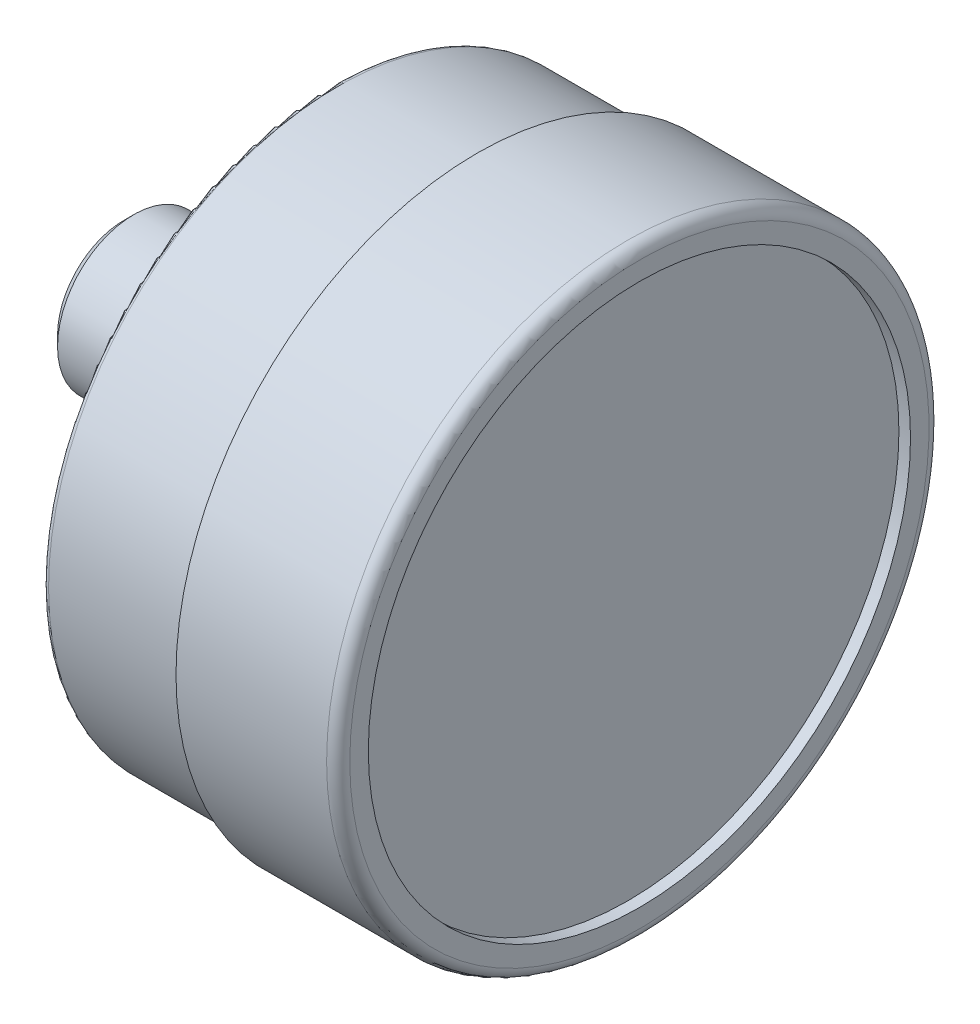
ISO-10303-21;
HEADER;
FILE_DESCRIPTION(('STEP AP214'),'2;1');
FILE_NAME('part.step','',(''),(''),'','','');
FILE_SCHEMA(('AUTOMOTIVE_DESIGN { 1 0 10303 214 1 1 1 1 }'));
ENDSEC;
DATA;
#1=APPLICATION_CONTEXT('core data for automotive mechanical design processes');
#2=APPLICATION_PROTOCOL_DEFINITION('international standard','automotive_design',2000,#1);
#3=PRODUCT_CONTEXT('',#1,'mechanical');
#4=PRODUCT('Part','Part','',(#3));
#5=PRODUCT_RELATED_PRODUCT_CATEGORY('part','',(#4));
#6=PRODUCT_DEFINITION_FORMATION('','',#4);
#7=PRODUCT_DEFINITION_CONTEXT('part definition',#1,'design');
#8=PRODUCT_DEFINITION('design','',#6,#7);
#9=PRODUCT_DEFINITION_SHAPE('','',#8);
#10=(LENGTH_UNIT() NAMED_UNIT(*) SI_UNIT(.MILLI.,.METRE.));
#11=(NAMED_UNIT(*) PLANE_ANGLE_UNIT() SI_UNIT($,.RADIAN.));
#12=(NAMED_UNIT(*) SI_UNIT($,.STERADIAN.) SOLID_ANGLE_UNIT());
#13=UNCERTAINTY_MEASURE_WITH_UNIT(LENGTH_MEASURE(1.E-05),#10,'distance_accuracy_value','');
#14=(GEOMETRIC_REPRESENTATION_CONTEXT(3) GLOBAL_UNCERTAINTY_ASSIGNED_CONTEXT((#13)) GLOBAL_UNIT_ASSIGNED_CONTEXT((#10,
#11,#12)) REPRESENTATION_CONTEXT('',''));
#15=CARTESIAN_POINT('',(0.,0.,0.));
#16=DIRECTION('',(0.,0.,1.));
#17=DIRECTION('',(1.,0.,0.));
#18=AXIS2_PLACEMENT_3D('',#15,#16,#17);
#19=CARTESIAN_POINT('',(0.,6.5785,0.));
#20=DIRECTION('',(1.,0.,0.));
#21=DIRECTION('',(0.,0.,-1.));
#22=AXIS2_PLACEMENT_3D('',#19,#20,#21);
#23=PLANE('',#22);
#24=CARTESIAN_POINT('',(0.,0.,0.));
#25=DIRECTION('',(-1.,0.,0.));
#26=DIRECTION('',(0.,0.,1.));
#27=AXIS2_PLACEMENT_3D('',#24,#25,#26);
#28=CIRCLE('',#27,24.5);
#29=CARTESIAN_POINT('',(0.,0.,24.5));
#30=VERTEX_POINT('',#29);
#31=EDGE_CURVE('E177',#30,#30,#28,.T.);
#32=ORIENTED_EDGE('',*,*,#31,.T.);
#33=EDGE_LOOP('',(#32));
#34=FACE_BOUND('',#33,.T.);
#35=DIRECTION('',(0.,-1.,0.));
#36=VECTOR('',#35,1.);
#37=CARTESIAN_POINT('',(0.,6.5785,6.5785));
#38=LINE('',#37,#36);
#39=CARTESIAN_POINT('',(0.,6.5785,6.5785));
#40=VERTEX_POINT('',#39);
#41=CARTESIAN_POINT('',(0.,-6.5785,6.5785));
#42=VERTEX_POINT('',#41);
#43=EDGE_CURVE('E110',#40,#42,#38,.T.);
#44=ORIENTED_EDGE('',*,*,#43,.T.);
#45=DIRECTION('',(0.,0.,-1.));
#46=VECTOR('',#45,1.);
#47=CARTESIAN_POINT('',(0.,-6.5785,6.5785));
#48=LINE('',#47,#46);
#49=CARTESIAN_POINT('',(0.,-6.5785,-6.5785));
#50=VERTEX_POINT('',#49);
#51=EDGE_CURVE('E95',#42,#50,#48,.T.);
#52=ORIENTED_EDGE('',*,*,#51,.T.);
#53=DIRECTION('',(0.,1.,0.));
#54=VECTOR('',#53,1.);
#55=CARTESIAN_POINT('',(0.,-6.5785,-6.5785));
#56=LINE('',#55,#54);
#57=CARTESIAN_POINT('',(0.,6.5785,-6.5785));
#58=VERTEX_POINT('',#57);
#59=EDGE_CURVE('E107',#50,#58,#56,.T.);
#60=ORIENTED_EDGE('',*,*,#59,.T.);
#61=DIRECTION('',(0.,0.,1.));
#62=VECTOR('',#61,1.);
#63=CARTESIAN_POINT('',(0.,6.5785,-6.5785));
#64=LINE('',#63,#62);
#65=EDGE_CURVE('E114',#58,#40,#64,.T.);
#66=ORIENTED_EDGE('',*,*,#65,.T.);
#67=EDGE_LOOP('',(#44,#52,#60,#66));
#68=FACE_BOUND('',#67,.T.);
#69=ADVANCED_FACE('F39',(#34,#68),#23,.F.);
#70=CARTESIAN_POINT('',(0.500000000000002,0.,0.));
#71=DIRECTION('',(-1.,0.,0.));
#72=DIRECTION('',(0.,0.,1.));
#73=AXIS2_PLACEMENT_3D('',#70,#71,#72);
#74=TOROIDAL_SURFACE('',#73,24.5,0.500000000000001);
#75=ORIENTED_EDGE('',*,*,#31,.F.);
#76=EDGE_LOOP('',(#75));
#77=FACE_BOUND('',#76,.T.);
#78=CARTESIAN_POINT('',(0.499999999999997,0.,0.));
#79=DIRECTION('',(-1.,0.,0.));
#80=DIRECTION('',(0.,0.,1.));
#81=AXIS2_PLACEMENT_3D('',#78,#79,#80);
#82=CIRCLE('',#81,25.);
#83=CARTESIAN_POINT('',(0.499999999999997,0.,25.));
#84=VERTEX_POINT('',#83);
#85=EDGE_CURVE('E174',#84,#84,#82,.T.);
#86=ORIENTED_EDGE('',*,*,#85,.T.);
#87=EDGE_LOOP('',(#86));
#88=FACE_BOUND('',#87,.T.);
#89=ADVANCED_FACE('F214',(#77,#88),#74,.T.);
#90=CARTESIAN_POINT('',(25.5,0.,0.));
#91=DIRECTION('',(-1.,0.,0.));
#92=DIRECTION('',(0.,0.,1.));
#93=AXIS2_PLACEMENT_3D('',#90,#91,#92);
#94=CYLINDRICAL_SURFACE('',#93,25.);
#95=ORIENTED_EDGE('',*,*,#85,.F.);
#96=EDGE_LOOP('',(#95));
#97=FACE_BOUND('',#96,.T.);
#98=CARTESIAN_POINT('',(12.5,0.,0.));
#99=DIRECTION('',(-1.,0.,0.));
#100=DIRECTION('',(0.,0.,1.));
#101=AXIS2_PLACEMENT_3D('',#98,#99,#100);
#102=CIRCLE('',#101,25.);
#103=CARTESIAN_POINT('',(12.5,0.,25.));
#104=VERTEX_POINT('',#103);
#105=EDGE_CURVE('E171',#104,#104,#102,.T.);
#106=ORIENTED_EDGE('',*,*,#105,.T.);
#107=EDGE_LOOP('',(#106));
#108=FACE_BOUND('',#107,.T.);
#109=ADVANCED_FACE('F220',(#97,#108),#94,.T.);
#110=CARTESIAN_POINT('',(12.5,25.,0.));
#111=DIRECTION('',(1.,0.,0.));
#112=DIRECTION('',(0.,0.,-1.));
#113=AXIS2_PLACEMENT_3D('',#110,#111,#112);
#114=PLANE('',#113);
#115=ORIENTED_EDGE('',*,*,#105,.F.);
#116=EDGE_LOOP('',(#115));
#117=FACE_BOUND('',#116,.T.);
#118=CARTESIAN_POINT('',(12.5,0.,0.));
#119=DIRECTION('',(-1.,0.,0.));
#120=DIRECTION('',(0.,0.,1.));
#121=AXIS2_PLACEMENT_3D('',#118,#119,#120);
#122=CIRCLE('',#121,26.);
#123=CARTESIAN_POINT('',(12.5,0.,26.));
#124=VERTEX_POINT('',#123);
#125=EDGE_CURVE('E168',#124,#124,#122,.T.);
#126=ORIENTED_EDGE('',*,*,#125,.T.);
#127=EDGE_LOOP('',(#126));
#128=FACE_BOUND('',#127,.T.);
#129=ADVANCED_FACE('F298',(#117,#128),#114,.F.);
#130=CARTESIAN_POINT('',(25.5,0.,0.));
#131=DIRECTION('',(-1.,0.,0.));
#132=DIRECTION('',(0.,0.,1.));
#133=AXIS2_PLACEMENT_3D('',#130,#131,#132);
#134=CYLINDRICAL_SURFACE('',#133,26.);
#135=ORIENTED_EDGE('',*,*,#125,.F.);
#136=EDGE_LOOP('',(#135));
#137=FACE_BOUND('',#136,.T.);
#138=CARTESIAN_POINT('',(25.5,0.,0.));
#139=DIRECTION('',(-1.,0.,0.));
#140=DIRECTION('',(0.,0.,1.));
#141=AXIS2_PLACEMENT_3D('',#138,#139,#140);
#142=CIRCLE('',#141,26.);
#143=CARTESIAN_POINT('',(25.5,0.,26.));
#144=VERTEX_POINT('',#143);
#145=EDGE_CURVE('E165',#144,#144,#142,.T.);
#146=ORIENTED_EDGE('',*,*,#145,.T.);
#147=EDGE_LOOP('',(#146));
#148=FACE_BOUND('',#147,.T.);
#149=ADVANCED_FACE('F290',(#137,#148),#134,.T.);
#150=CARTESIAN_POINT('',(25.5,0.,0.));
#151=DIRECTION('',(-1.,0.,0.));
#152=DIRECTION('',(0.,0.,1.));
#153=AXIS2_PLACEMENT_3D('',#150,#151,#152);
#154=TOROIDAL_SURFACE('',#153,25.,1.00000000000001);
#155=ORIENTED_EDGE('',*,*,#145,.F.);
#156=EDGE_LOOP('',(#155));
#157=FACE_BOUND('',#156,.T.);
#158=CARTESIAN_POINT('',(26.5,0.,0.));
#159=DIRECTION('',(-1.,0.,0.));
#160=DIRECTION('',(0.,0.,1.));
#161=AXIS2_PLACEMENT_3D('',#158,#159,#160);
#162=CIRCLE('',#161,25.);
#163=CARTESIAN_POINT('',(26.5,0.,25.));
#164=VERTEX_POINT('',#163);
#165=EDGE_CURVE('E162',#164,#164,#162,.T.);
#166=ORIENTED_EDGE('',*,*,#165,.T.);
#167=EDGE_LOOP('',(#166));
#168=FACE_BOUND('',#167,.T.);
#169=ADVANCED_FACE('F281',(#157,#168),#154,.T.);
#170=CARTESIAN_POINT('',(26.5,25.,0.));
#171=DIRECTION('',(-1.,0.,0.));
#172=DIRECTION('',(0.,0.,1.));
#173=AXIS2_PLACEMENT_3D('',#170,#171,#172);
#174=PLANE('',#173);
#175=ORIENTED_EDGE('',*,*,#165,.F.);
#176=EDGE_LOOP('',(#175));
#177=FACE_BOUND('',#176,.T.);
#178=CARTESIAN_POINT('',(26.5,0.,0.));
#179=DIRECTION('',(-1.,0.,0.));
#180=DIRECTION('',(0.,0.,1.));
#181=AXIS2_PLACEMENT_3D('',#178,#179,#180);
#182=CIRCLE('',#181,23.4);
#183=CARTESIAN_POINT('',(26.5,0.,23.4));
#184=VERTEX_POINT('',#183);
#185=EDGE_CURVE('E159',#184,#184,#182,.T.);
#186=ORIENTED_EDGE('',*,*,#185,.T.);
#187=EDGE_LOOP('',(#186));
#188=FACE_BOUND('',#187,.T.);
#189=ADVANCED_FACE('F271',(#177,#188),#174,.F.);
#190=CARTESIAN_POINT('',(25.5,0.,0.));
#191=DIRECTION('',(-1.,0.,0.));
#192=DIRECTION('',(0.,0.,1.));
#193=AXIS2_PLACEMENT_3D('',#190,#191,#192);
#194=CYLINDRICAL_SURFACE('',#193,23.4);
#195=ORIENTED_EDGE('',*,*,#185,.F.);
#196=EDGE_LOOP('',(#195));
#197=FACE_BOUND('',#196,.T.);
#198=CARTESIAN_POINT('',(25.5,0.,0.));
#199=DIRECTION('',(-1.,0.,0.));
#200=DIRECTION('',(0.,0.,1.));
#201=AXIS2_PLACEMENT_3D('',#198,#199,#200);
#202=CIRCLE('',#201,23.4);
#203=CARTESIAN_POINT('',(25.5,0.,23.4));
#204=VERTEX_POINT('',#203);
#205=EDGE_CURVE('E156',#204,#204,#202,.T.);
#206=ORIENTED_EDGE('',*,*,#205,.T.);
#207=EDGE_LOOP('',(#206));
#208=FACE_BOUND('',#207,.T.);
#209=ADVANCED_FACE('F264',(#197,#208),#194,.F.);
#210=CARTESIAN_POINT('',(25.5,23.4,0.));
#211=DIRECTION('',(-1.,0.,0.));
#212=DIRECTION('',(0.,0.,1.));
#213=AXIS2_PLACEMENT_3D('',#210,#211,#212);
#214=PLANE('',#213);
#215=ORIENTED_EDGE('',*,*,#205,.F.);
#216=EDGE_LOOP('',(#215));
#217=FACE_BOUND('',#216,.T.);
#218=ADVANCED_FACE('F146',(#217),#214,.F.);
#219=CARTESIAN_POINT('',(-22.25,6.5785,6.5785));
#220=DIRECTION('',(0.,0.,1.));
#221=DIRECTION('',(1.,0.,0.));
#222=AXIS2_PLACEMENT_3D('',#219,#220,#221);
#223=PLANE('',#222);
#224=CARTESIAN_POINT('',(-9.,0.,6.5785));
#225=CARTESIAN_POINT('',(-8.99999297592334,-0.44685698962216,6.5785));
#226=CARTESIAN_POINT('',(-8.98073108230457,-0.893777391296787,6.5785));
#227=CARTESIAN_POINT('',(-8.904238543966,-1.78439195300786,6.5785));
#228=CARTESIAN_POINT('',(-8.8469996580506,-2.22808539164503,6.5785));
#229=CARTESIAN_POINT('',(-8.69588183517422,-3.10983216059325,6.5785));
#230=CARTESIAN_POINT('',(-8.6019512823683,-3.54787664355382,6.5785));
#231=CARTESIAN_POINT('',(-8.37929043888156,-4.4148961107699,6.5785));
#232=CARTESIAN_POINT('',(-8.25056081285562,-4.84387126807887,6.5785));
#233=CARTESIAN_POINT('',(-7.81605283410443,-6.11008533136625,6.5785));
#234=CARTESIAN_POINT('',(-7.46118448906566,-6.93095154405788,6.5785));
#235=CARTESIAN_POINT('',(-6.63353373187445,-8.51039385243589,6.5785));
#236=CARTESIAN_POINT('',(-6.16076803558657,-9.26897875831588,6.5785));
#237=CARTESIAN_POINT('',(-5.34049965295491,-10.3933305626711,6.5785));
#238=CARTESIAN_POINT('',(-5.02877045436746,-10.7856768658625,6.5785));
#239=CARTESIAN_POINT('',(-4.37430655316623,-11.5437634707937,6.5785));
#240=CARTESIAN_POINT('',(-4.03156961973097,-11.909501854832,6.5785));
#241=CARTESIAN_POINT('',(-3.31747288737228,-12.6120677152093,6.5785));
#242=CARTESIAN_POINT('',(-2.94610425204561,-12.9488861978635,6.5785));
#243=CARTESIAN_POINT('',(-2.17735666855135,-13.5914088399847,6.5785));
#244=CARTESIAN_POINT('',(-1.77997744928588,-13.8971126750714,6.5785));
#245=CARTESIAN_POINT('',(-0.946731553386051,-14.4861850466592,6.5785));
#246=CARTESIAN_POINT('',(-0.509985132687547,-14.7683100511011,6.5785));
#247=CARTESIAN_POINT('',(0.385530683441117,-15.2951415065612,6.5785));
#248=CARTESIAN_POINT('',(0.844300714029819,-15.5398468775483,6.5785));
#249=CARTESIAN_POINT('',(1.78065827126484,-15.9901959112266,6.5785));
#250=CARTESIAN_POINT('',(2.25824678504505,-16.1958375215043,6.5785));
#251=CARTESIAN_POINT('',(3.22888005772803,-16.5666548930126,6.5785));
#252=CARTESIAN_POINT('',(3.72192481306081,-16.7318306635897,6.5785));
#253=CARTESIAN_POINT('',(4.72536118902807,-17.0221403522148,6.5785));
#254=CARTESIAN_POINT('',(5.23588159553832,-17.1468293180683,6.5785));
#255=CARTESIAN_POINT('',(6.26559558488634,-17.3528769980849,6.5785));
#256=CARTESIAN_POINT('',(6.78478924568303,-17.4342353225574,6.5785));
#257=CARTESIAN_POINT('',(7.82817679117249,-17.5530597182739,6.5785));
#258=CARTESIAN_POINT('',(8.35237068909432,-17.5905256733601,6.5785));
#259=CARTESIAN_POINT('',(9.40205241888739,-17.6213063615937,6.5785));
#260=CARTESIAN_POINT('',(9.92754025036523,-17.6146211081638,6.5785));
#261=CARTESIAN_POINT('',(10.9776181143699,-17.5570620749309,6.5785));
#262=CARTESIAN_POINT('',(11.5022011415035,-17.5060604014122,6.5785));
#263=CARTESIAN_POINT('',(12.5452080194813,-17.3600495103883,6.5785));
#264=CARTESIAN_POINT('',(13.0636318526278,-17.2650401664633,6.5785));
#265=CARTESIAN_POINT('',(14.0906565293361,-17.0316669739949,6.5785));
#266=CARTESIAN_POINT('',(14.5992568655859,-16.8933008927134,6.5785));
#267=CARTESIAN_POINT('',(15.6029793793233,-16.5741754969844,6.5785));
#268=CARTESIAN_POINT('',(16.0981015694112,-16.3934162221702,6.5785));
#269=CARTESIAN_POINT('',(17.0711849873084,-15.9908158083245,6.5785));
#270=CARTESIAN_POINT('',(17.5491511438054,-15.7689865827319,6.5785));
#271=CARTESIAN_POINT('',(18.4846402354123,-15.2857471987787,6.5785));
#272=CARTESIAN_POINT('',(18.942163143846,-15.024336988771,6.5785));
#273=CARTESIAN_POINT('',(19.8333878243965,-14.4637862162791,6.5785));
#274=CARTESIAN_POINT('',(20.2670931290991,-14.1646512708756,6.5785));
#275=CARTESIAN_POINT('',(21.1075833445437,-13.5306879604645,6.5785));
#276=CARTESIAN_POINT('',(21.5143683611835,-13.1958597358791,6.5785));
#277=CARTESIAN_POINT('',(22.2962880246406,-12.4943516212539,6.5785));
#278=CARTESIAN_POINT('',(22.6715526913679,-12.127816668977,6.5785));
#279=CARTESIAN_POINT('',(23.3895610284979,-11.3641568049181,6.5785));
#280=CARTESIAN_POINT('',(23.7323045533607,-10.9670317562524,6.5785));
#281=CARTESIAN_POINT('',(24.3827740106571,-10.1446397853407,6.5785));
#282=CARTESIAN_POINT('',(24.6904770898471,-9.71935477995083,6.5785));
#283=CARTESIAN_POINT('',(25.2680024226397,-8.84378740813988,6.5785));
#284=CARTESIAN_POINT('',(25.5378251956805,-8.3935053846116,6.5785));
#285=CARTESIAN_POINT('',(26.0332853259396,-7.47797669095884,6.5785));
#286=CARTESIAN_POINT('',(26.2595257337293,-7.0130565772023,6.5785));
#287=CARTESIAN_POINT('',(26.6702883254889,-6.06514800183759,6.5785));
#288=CARTESIAN_POINT('',(26.8548139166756,-5.5821610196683,6.5785));
#289=CARTESIAN_POINT('',(27.1793487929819,-4.60208371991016,6.5785));
#290=CARTESIAN_POINT('',(27.3194133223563,-4.10501174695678,6.5785));
#291=CARTESIAN_POINT('',(27.552545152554,-3.09996513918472,6.5785));
#292=CARTESIAN_POINT('',(27.6456187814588,-2.59199198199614,6.5785));
#293=CARTESIAN_POINT('',(27.7775902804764,-1.60358559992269,6.5785));
#294=CARTESIAN_POINT('',(27.8196929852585,-1.12358057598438,6.5785));
#295=CARTESIAN_POINT('',(27.8593379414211,-0.161743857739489,6.5785));
#296=CARTESIAN_POINT('',(27.8568836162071,0.320087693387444,6.5785));
#297=CARTESIAN_POINT('',(27.8075061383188,1.28147446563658,6.5785));
#298=CARTESIAN_POINT('',(27.76057993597,1.76102952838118,6.5785));
#299=CARTESIAN_POINT('',(27.6237395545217,2.71395733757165,6.5785));
#300=CARTESIAN_POINT('',(27.533823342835,3.18732979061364,6.5785));
#301=CARTESIAN_POINT('',(27.3216044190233,4.08864272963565,6.5785));
#302=CARTESIAN_POINT('',(27.2022956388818,4.51729420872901,6.5785));
#303=CARTESIAN_POINT('',(26.930647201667,5.36394084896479,6.5785));
#304=CARTESIAN_POINT('',(26.7783105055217,5.78193696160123,6.5785));
#305=CARTESIAN_POINT('',(26.4422396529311,6.60523425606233,6.5785));
#306=CARTESIAN_POINT('',(26.2584962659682,7.01053166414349,6.5785));
#307=CARTESIAN_POINT('',(25.861235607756,7.80628004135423,6.5785));
#308=CARTESIAN_POINT('',(25.6477158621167,8.19672977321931,6.5785));
#309=CARTESIAN_POINT('',(25.1698007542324,8.99885630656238,6.5785));
#310=CARTESIAN_POINT('',(24.9024571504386,9.4087795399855,6.5785));
#311=CARTESIAN_POINT('',(24.3357408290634,10.2058576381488,6.5785));
#312=CARTESIAN_POINT('',(24.036366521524,10.5930113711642,6.5785));
#313=CARTESIAN_POINT('',(23.4077151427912,11.3422577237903,6.5785));
#314=CARTESIAN_POINT('',(23.078436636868,11.7043491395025,6.5785));
#315=CARTESIAN_POINT('',(22.3922227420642,12.4012926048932,6.5785));
#316=CARTESIAN_POINT('',(22.0352870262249,12.7361443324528,6.5785));
#317=CARTESIAN_POINT('',(21.2757348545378,13.3942497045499,6.5785));
#318=CARTESIAN_POINT('',(20.8716855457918,13.7158514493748,6.5785));
#319=CARTESIAN_POINT('',(20.0382611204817,14.3243863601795,6.5785));
#320=CARTESIAN_POINT('',(19.6088850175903,14.6113181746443,6.5785));
#321=CARTESIAN_POINT('',(18.7277441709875,15.1486492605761,6.5785));
#322=CARTESIAN_POINT('',(18.2759753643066,15.3990418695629,6.5785));
#323=CARTESIAN_POINT('',(17.3532628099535,15.8615649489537,6.5785));
#324=CARTESIAN_POINT('',(16.8823190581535,16.0736954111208,6.5785));
#325=CARTESIAN_POINT('',(15.9171051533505,16.4612533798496,6.5785));
#326=CARTESIAN_POINT('',(15.422587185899,16.6360639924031,6.5785));
#327=CARTESIAN_POINT('',(14.420624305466,16.943578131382,6.5785));
#328=CARTESIAN_POINT('',(13.9131792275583,17.0762811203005,6.5785));
#329=CARTESIAN_POINT('',(12.8889537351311,17.298665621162,6.5785));
#330=CARTESIAN_POINT('',(12.3721734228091,17.3883476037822,6.5785));
#331=CARTESIAN_POINT('',(11.3329151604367,17.5240757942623,6.5785));
#332=CARTESIAN_POINT('',(10.8104372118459,17.5701220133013,6.5785));
#333=CARTESIAN_POINT('',(9.76115429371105,17.6183681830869,6.5785));
#334=CARTESIAN_POINT('',(9.2343404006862,17.620374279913,6.5785));
#335=CARTESIAN_POINT('',(8.18241207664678,17.5800321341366,6.5785));
#336=CARTESIAN_POINT('',(7.65729765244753,17.5376837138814,6.5785));
#337=CARTESIAN_POINT('',(6.61247791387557,17.4089234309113,6.5785));
#338=CARTESIAN_POINT('',(6.09277281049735,17.3225098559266,6.5785));
#339=CARTESIAN_POINT('',(5.06248741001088,17.106217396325,6.5785));
#340=CARTESIAN_POINT('',(4.55190710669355,16.9763385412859,6.5785));
#341=CARTESIAN_POINT('',(3.54323019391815,16.6739324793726,6.5785));
#342=CARTESIAN_POINT('',(3.04514058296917,16.5013819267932,6.5785));
#343=CARTESIAN_POINT('',(2.06529645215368,16.1148648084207,6.5785));
#344=CARTESIAN_POINT('',(1.58354196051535,15.9008981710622,6.5785));
#345=CARTESIAN_POINT('',(0.639875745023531,15.4330551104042,6.5785));
#346=CARTESIAN_POINT('',(0.177962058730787,15.1791826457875,6.5785));
#347=CARTESIAN_POINT('',(-0.72273313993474,14.6332708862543,6.5785));
#348=CARTESIAN_POINT('',(-1.16151474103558,14.3412317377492,6.5785));
#349=CARTESIAN_POINT('',(-2.01151612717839,13.7219008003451,6.5785));
#350=CARTESIAN_POINT('',(-2.42281169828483,13.3947130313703,6.5785));
#351=CARTESIAN_POINT('',(-3.21619229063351,12.7066430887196,6.5785));
#352=CARTESIAN_POINT('',(-3.59827709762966,12.3457606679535,6.5785));
#353=CARTESIAN_POINT('',(-4.33053913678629,11.5925835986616,6.5785));
#354=CARTESIAN_POINT('',(-4.68069959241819,11.2002726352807,6.5785));
#355=CARTESIAN_POINT('',(-5.34613019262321,10.3871046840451,6.5785));
#356=CARTESIAN_POINT('',(-5.66140132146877,9.96624850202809,6.5785));
#357=CARTESIAN_POINT('',(-6.25147259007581,9.10319728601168,6.5785));
#358=CARTESIAN_POINT('',(-6.52664453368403,8.66125652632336,6.5785));
#359=CARTESIAN_POINT('',(-7.03784515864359,7.75498492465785,6.5785));
#360=CARTESIAN_POINT('',(-7.27385535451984,7.29064364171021,6.5785));
#361=CARTESIAN_POINT('',(-7.70365808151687,6.34383130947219,6.5785));
#362=CARTESIAN_POINT('',(-7.89752699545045,5.86139495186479,6.5785));
#363=CARTESIAN_POINT('',(-8.24099473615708,4.88085826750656,6.5785));
#364=CARTESIAN_POINT('',(-8.39059041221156,4.38275682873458,6.5785));
#365=CARTESIAN_POINT('',(-8.59586683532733,3.56192144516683,6.5785));
#366=CARTESIAN_POINT('',(-8.66579919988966,3.2426890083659,6.5785));
#367=CARTESIAN_POINT('',(-8.78633374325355,2.60060950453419,6.5785));
#368=CARTESIAN_POINT('',(-8.83693862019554,2.27776294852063,6.5785));
#369=CARTESIAN_POINT('',(-8.9181766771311,1.62972065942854,6.5785));
#370=CARTESIAN_POINT('',(-8.94881962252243,1.30452615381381,6.5785));
#371=CARTESIAN_POINT('',(-8.98973292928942,0.65289897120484,6.5785));
#372=CARTESIAN_POINT('',(-9.00000513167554,0.326466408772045,6.5785));
#373=CARTESIAN_POINT('',(-9.,0.,6.5785));
#374=B_SPLINE_CURVE_WITH_KNOTS('',3,(#224,#225,#226,#227,#228,#229,#230,#231,#232,#233,#234,
#235,#236,#237,#238,#239,#240,#241,#242,#243,#244,#245,#246,#247,#248,#249,#250,#251,#252,#253,
#254,#255,#256,#257,#258,#259,#260,#261,#262,#263,#264,#265,#266,#267,#268,#269,#270,#271,#272,
#273,#274,#275,#276,#277,#278,#279,#280,#281,#282,#283,#284,#285,#286,#287,#288,#289,#290,#291,
#292,#293,#294,#295,#296,#297,#298,#299,#300,#301,#302,#303,#304,#305,#306,#307,#308,#309,#310,
#311,#312,#313,#314,#315,#316,#317,#318,#319,#320,#321,#322,#323,#324,#325,#326,#327,#328,#329,
#330,#331,#332,#333,#334,#335,#336,#337,#338,#339,#340,#341,#342,#343,#344,#345,#346,#347,#348,
#349,#350,#351,#352,#353,#354,#355,#356,#357,#358,#359,#360,#361,#362,#363,#364,#365,#366,#367,
#368,#369,#370,#371,#372,#373),.UNSPECIFIED.,.T.,.F.,(4,2,2,2,2,2,2,2,2,2,2,2,2,2,2,2,2,2,2,2,2,
2,2,2,2,2,2,2,2,2,2,2,2,2,2,2,2,2,2,2,2,2,2,2,2,2,2,2,2,2,2,2,2,2,2,2,2,2,2,2,2,2,2,2,2,2,2,2,2,
2,2,2,2,2,4),(0.,1.34027081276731,2.68083256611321,4.02328697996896,5.36571575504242,
8.03749967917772,10.7089050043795,12.2107766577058,13.71275644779,15.2152016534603,
16.7176625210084,18.2756682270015,19.8337188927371,21.3918513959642,22.9499835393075,
24.5247016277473,26.0994338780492,27.6741702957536,29.2489062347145,30.8282018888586,
32.4075020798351,33.9868836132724,35.5662636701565,37.1451863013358,38.7241109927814,
40.3028008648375,41.8814845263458,43.4532987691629,45.0251200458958,46.5979606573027,
48.1707796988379,49.7199637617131,51.269021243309,52.8161463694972,54.3630630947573,
55.806600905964,57.2500278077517,58.6935537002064,60.1371478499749,61.4706152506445,
62.8039631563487,64.1377036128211,65.4715549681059,66.9381271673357,68.4047721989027,
69.8714876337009,71.3382204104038,72.8856561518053,74.4331521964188,75.9809300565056,
77.5287082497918,79.1003708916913,80.6720535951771,82.2437191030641,83.8153842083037,
85.3939660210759,86.9725541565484,88.5512036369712,90.1298520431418,91.7093660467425,
93.2888827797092,94.8682429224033,96.4475970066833,98.0223995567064,99.5972136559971,
101.172850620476,102.748443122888,104.308343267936,105.868977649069,107.426759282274,
108.984651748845,109.964536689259,110.944284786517,111.923553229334,112.902733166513),.UNSPECIFIED.);
#375=CARTESIAN_POINT('',(-9.,0.,6.5785));
#376=VERTEX_POINT('',#375);
#377=CARTESIAN_POINT('',(-7.5950145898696,-6.5785,6.5785));
#378=VERTEX_POINT('',#377);
#379=EDGE_CURVE('E151',#376,#378,#374,.T.);
#380=ORIENTED_EDGE('',*,*,#379,.T.);
#381=DIRECTION('',(1.,0.,0.));
#382=VECTOR('',#381,1.);
#383=CARTESIAN_POINT('',(-22.25,-6.5785,6.5785));
#384=LINE('',#383,#382);
#385=EDGE_CURVE('E55',#378,#42,#384,.T.);
#386=ORIENTED_EDGE('',*,*,#385,.T.);
#387=ORIENTED_EDGE('',*,*,#43,.F.);
#388=DIRECTION('',(1.,0.,0.));
#389=VECTOR('',#388,1.);
#390=CARTESIAN_POINT('',(-22.25,6.5785,6.5785));
#391=LINE('',#390,#389);
#392=CARTESIAN_POINT('',(-7.59501458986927,6.5785,6.5785));
#393=VERTEX_POINT('',#392);
#394=EDGE_CURVE('E119',#393,#40,#391,.T.);
#395=ORIENTED_EDGE('',*,*,#394,.F.);
#396=EDGE_CURVE('E62',#393,#376,#374,.T.);
#397=ORIENTED_EDGE('',*,*,#396,.T.);
#398=EDGE_LOOP('',(#380,#386,#387,#395,#397));
#399=FACE_BOUND('',#398,.T.);
#400=ADVANCED_FACE('F142',(#399),#223,.T.);
#401=CARTESIAN_POINT('',(-22.25,6.5785,-6.5785));
#402=DIRECTION('',(0.,1.,0.));
#403=DIRECTION('',(0.,0.,1.));
#404=AXIS2_PLACEMENT_3D('',#401,#402,#403);
#405=PLANE('',#404);
#406=CARTESIAN_POINT('',(-9.,6.5785,0.));
#407=CARTESIAN_POINT('',(-8.99999297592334,6.5785,0.446856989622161));
#408=CARTESIAN_POINT('',(-8.98073108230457,6.5785,0.893777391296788));
#409=CARTESIAN_POINT('',(-8.904238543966,6.5785,1.78439195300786));
#410=CARTESIAN_POINT('',(-8.8469996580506,6.5785,2.22808539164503));
#411=CARTESIAN_POINT('',(-8.69588183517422,6.5785,3.10983216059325));
#412=CARTESIAN_POINT('',(-8.6019512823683,6.5785,3.54787664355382));
#413=CARTESIAN_POINT('',(-8.37929043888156,6.5785,4.4148961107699));
#414=CARTESIAN_POINT('',(-8.25056081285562,6.5785,4.84387126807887));
#415=CARTESIAN_POINT('',(-7.81605283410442,6.5785,6.11008533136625));
#416=CARTESIAN_POINT('',(-7.46118448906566,6.5785,6.93095154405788));
#417=CARTESIAN_POINT('',(-6.63353373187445,6.5785,8.51039385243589));
#418=CARTESIAN_POINT('',(-6.16076803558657,6.5785,9.26897875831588));
#419=CARTESIAN_POINT('',(-5.34049965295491,6.5785,10.3933305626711));
#420=CARTESIAN_POINT('',(-5.02877045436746,6.5785,10.7856768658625));
#421=CARTESIAN_POINT('',(-4.37430655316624,6.5785,11.5437634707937));
#422=CARTESIAN_POINT('',(-4.03156961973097,6.5785,11.909501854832));
#423=CARTESIAN_POINT('',(-3.31747288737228,6.5785,12.6120677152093));
#424=CARTESIAN_POINT('',(-2.94610425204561,6.5785,12.9488861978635));
#425=CARTESIAN_POINT('',(-2.17735666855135,6.5785,13.5914088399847));
#426=CARTESIAN_POINT('',(-1.77997744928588,6.5785,13.8971126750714));
#427=CARTESIAN_POINT('',(-0.946731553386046,6.5785,14.4861850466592));
#428=CARTESIAN_POINT('',(-0.509985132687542,6.5785,14.7683100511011));
#429=CARTESIAN_POINT('',(0.38553068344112,6.5785,15.2951415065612));
#430=CARTESIAN_POINT('',(0.844300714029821,6.5785,15.5398468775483));
#431=CARTESIAN_POINT('',(1.78065827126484,6.5785,15.9901959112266));
#432=CARTESIAN_POINT('',(2.25824678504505,6.5785,16.1958375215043));
#433=CARTESIAN_POINT('',(3.22888005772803,6.5785,16.5666548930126));
#434=CARTESIAN_POINT('',(3.72192481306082,6.5785,16.7318306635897));
#435=CARTESIAN_POINT('',(4.72536118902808,6.5785,17.0221403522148));
#436=CARTESIAN_POINT('',(5.23588159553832,6.5785,17.1468293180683));
#437=CARTESIAN_POINT('',(6.26559558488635,6.5785,17.3528769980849));
#438=CARTESIAN_POINT('',(6.78478924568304,6.5785,17.4342353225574));
#439=CARTESIAN_POINT('',(7.8281767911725,6.5785,17.5530597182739));
#440=CARTESIAN_POINT('',(8.35237068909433,6.5785,17.5905256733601));
#441=CARTESIAN_POINT('',(9.4020524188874,6.5785,17.6213063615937));
#442=CARTESIAN_POINT('',(9.92754025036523,6.5785,17.6146211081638));
#443=CARTESIAN_POINT('',(10.9776181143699,6.5785,17.5570620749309));
#444=CARTESIAN_POINT('',(11.5022011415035,6.5785,17.5060604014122));
#445=CARTESIAN_POINT('',(12.5452080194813,6.5785,17.3600495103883));
#446=CARTESIAN_POINT('',(13.0636318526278,6.5785,17.2650401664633));
#447=CARTESIAN_POINT('',(14.0906565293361,6.5785,17.0316669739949));
#448=CARTESIAN_POINT('',(14.5992568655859,6.5785,16.8933008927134));
#449=CARTESIAN_POINT('',(15.6029793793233,6.5785,16.5741754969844));
#450=CARTESIAN_POINT('',(16.0981015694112,6.5785,16.3934162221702));
#451=CARTESIAN_POINT('',(17.0711849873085,6.5785,15.9908158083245));
#452=CARTESIAN_POINT('',(17.5491511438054,6.5785,15.7689865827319));
#453=CARTESIAN_POINT('',(18.4846402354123,6.5785,15.2857471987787));
#454=CARTESIAN_POINT('',(18.942163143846,6.5785,15.024336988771));
#455=CARTESIAN_POINT('',(19.8333878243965,6.5785,14.4637862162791));
#456=CARTESIAN_POINT('',(20.2670931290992,6.5785,14.1646512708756));
#457=CARTESIAN_POINT('',(21.1075833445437,6.5785,13.5306879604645));
#458=CARTESIAN_POINT('',(21.5143683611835,6.5785,13.1958597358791));
#459=CARTESIAN_POINT('',(22.2962880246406,6.5785,12.4943516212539));
#460=CARTESIAN_POINT('',(22.6715526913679,6.5785,12.127816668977));
#461=CARTESIAN_POINT('',(23.3895610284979,6.5785,11.3641568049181));
#462=CARTESIAN_POINT('',(23.7323045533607,6.5785,10.9670317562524));
#463=CARTESIAN_POINT('',(24.3827740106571,6.5785,10.1446397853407));
#464=CARTESIAN_POINT('',(24.6904770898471,6.5785,9.71935477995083));
#465=CARTESIAN_POINT('',(25.2680024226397,6.5785,8.84378740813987));
#466=CARTESIAN_POINT('',(25.5378251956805,6.5785,8.3935053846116));
#467=CARTESIAN_POINT('',(26.0332853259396,6.5785,7.47797669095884));
#468=CARTESIAN_POINT('',(26.2595257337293,6.5785,7.0130565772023));
#469=CARTESIAN_POINT('',(26.6702883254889,6.5785,6.06514800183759));
#470=CARTESIAN_POINT('',(26.8548139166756,6.5785,5.5821610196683));
#471=CARTESIAN_POINT('',(27.1793487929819,6.5785,4.60208371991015));
#472=CARTESIAN_POINT('',(27.3194133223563,6.5785,4.10501174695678));
#473=CARTESIAN_POINT('',(27.552545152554,6.5785,3.09996513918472));
#474=CARTESIAN_POINT('',(27.6456187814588,6.5785,2.59199198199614));
#475=CARTESIAN_POINT('',(27.7775902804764,6.5785,1.60358559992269));
#476=CARTESIAN_POINT('',(27.8196929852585,6.5785,1.12358057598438));
#477=CARTESIAN_POINT('',(27.8593379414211,6.5785,0.161743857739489));
#478=CARTESIAN_POINT('',(27.8568836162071,6.5785,-0.320087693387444));
#479=CARTESIAN_POINT('',(27.8075061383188,6.5785,-1.28147446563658));
#480=CARTESIAN_POINT('',(27.76057993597,6.5785,-1.76102952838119));
#481=CARTESIAN_POINT('',(27.6237395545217,6.5785,-2.71395733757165));
#482=CARTESIAN_POINT('',(27.533823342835,6.5785,-3.18732979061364));
#483=CARTESIAN_POINT('',(27.3216044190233,6.5785,-4.08864272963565));
#484=CARTESIAN_POINT('',(27.2022956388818,6.5785,-4.51729420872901));
#485=CARTESIAN_POINT('',(26.930647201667,6.5785,-5.36394084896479));
#486=CARTESIAN_POINT('',(26.7783105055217,6.5785,-5.78193696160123));
#487=CARTESIAN_POINT('',(26.4422396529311,6.5785,-6.60523425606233));
#488=CARTESIAN_POINT('',(26.2584962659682,6.5785,-7.01053166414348));
#489=CARTESIAN_POINT('',(25.861235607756,6.5785,-7.80628004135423));
#490=CARTESIAN_POINT('',(25.6477158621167,6.5785,-8.19672977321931));
#491=CARTESIAN_POINT('',(25.1698007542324,6.5785,-8.99885630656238));
#492=CARTESIAN_POINT('',(24.9024571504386,6.5785,-9.4087795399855));
#493=CARTESIAN_POINT('',(24.3357408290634,6.5785,-10.2058576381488));
#494=CARTESIAN_POINT('',(24.036366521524,6.5785,-10.5930113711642));
#495=CARTESIAN_POINT('',(23.4077151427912,6.5785,-11.3422577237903));
#496=CARTESIAN_POINT('',(23.078436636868,6.5785,-11.7043491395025));
#497=CARTESIAN_POINT('',(22.3922227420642,6.5785,-12.4012926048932));
#498=CARTESIAN_POINT('',(22.0352870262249,6.5785,-12.7361443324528));
#499=CARTESIAN_POINT('',(21.2757348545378,6.5785,-13.3942497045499));
#500=CARTESIAN_POINT('',(20.8716855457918,6.5785,-13.7158514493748));
#501=CARTESIAN_POINT('',(20.0382611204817,6.5785,-14.3243863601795));
#502=CARTESIAN_POINT('',(19.6088850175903,6.5785,-14.6113181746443));
#503=CARTESIAN_POINT('',(18.7277441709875,6.5785,-15.1486492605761));
#504=CARTESIAN_POINT('',(18.2759753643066,6.5785,-15.3990418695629));
#505=CARTESIAN_POINT('',(17.3532628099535,6.5785,-15.8615649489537));
#506=CARTESIAN_POINT('',(16.8823190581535,6.5785,-16.0736954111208));
#507=CARTESIAN_POINT('',(15.9171051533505,6.5785,-16.4612533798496));
#508=CARTESIAN_POINT('',(15.422587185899,6.5785,-16.6360639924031));
#509=CARTESIAN_POINT('',(14.420624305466,6.5785,-16.943578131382));
#510=CARTESIAN_POINT('',(13.9131792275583,6.5785,-17.0762811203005));
#511=CARTESIAN_POINT('',(12.8889537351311,6.5785,-17.298665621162));
#512=CARTESIAN_POINT('',(12.3721734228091,6.5785,-17.3883476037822));
#513=CARTESIAN_POINT('',(11.3329151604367,6.5785,-17.5240757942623));
#514=CARTESIAN_POINT('',(10.8104372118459,6.5785,-17.5701220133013));
#515=CARTESIAN_POINT('',(9.76115429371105,6.5785,-17.6183681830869));
#516=CARTESIAN_POINT('',(9.23434040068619,6.5785,-17.620374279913));
#517=CARTESIAN_POINT('',(8.18241207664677,6.5785,-17.5800321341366));
#518=CARTESIAN_POINT('',(7.65729765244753,6.5785,-17.5376837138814));
#519=CARTESIAN_POINT('',(6.61247791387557,6.5785,-17.4089234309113));
#520=CARTESIAN_POINT('',(6.09277281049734,6.5785,-17.3225098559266));
#521=CARTESIAN_POINT('',(5.06248741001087,6.5785,-17.106217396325));
#522=CARTESIAN_POINT('',(4.55190710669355,6.5785,-16.9763385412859));
#523=CARTESIAN_POINT('',(3.54323019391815,6.5785,-16.6739324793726));
#524=CARTESIAN_POINT('',(3.04514058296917,6.5785,-16.5013819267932));
#525=CARTESIAN_POINT('',(2.06529645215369,6.5785,-16.1148648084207));
#526=CARTESIAN_POINT('',(1.58354196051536,6.5785,-15.9008981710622));
#527=CARTESIAN_POINT('',(0.639875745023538,6.5785,-15.4330551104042));
#528=CARTESIAN_POINT('',(0.17796205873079,6.5785,-15.1791826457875));
#529=CARTESIAN_POINT('',(-0.722733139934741,6.5785,-14.6332708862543));
#530=CARTESIAN_POINT('',(-1.16151474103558,6.5785,-14.3412317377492));
#531=CARTESIAN_POINT('',(-2.01151612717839,6.5785,-13.7219008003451));
#532=CARTESIAN_POINT('',(-2.42281169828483,6.5785,-13.3947130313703));
#533=CARTESIAN_POINT('',(-3.21619229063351,6.5785,-12.7066430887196));
#534=CARTESIAN_POINT('',(-3.59827709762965,6.5785,-12.3457606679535));
#535=CARTESIAN_POINT('',(-4.33053913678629,6.5785,-11.5925835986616));
#536=CARTESIAN_POINT('',(-4.68069959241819,6.5785,-11.2002726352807));
#537=CARTESIAN_POINT('',(-5.34613019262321,6.5785,-10.3871046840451));
#538=CARTESIAN_POINT('',(-5.66140132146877,6.5785,-9.96624850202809));
#539=CARTESIAN_POINT('',(-6.25147259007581,6.5785,-9.10319728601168));
#540=CARTESIAN_POINT('',(-6.52664453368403,6.5785,-8.66125652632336));
#541=CARTESIAN_POINT('',(-7.03784515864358,6.5785,-7.75498492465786));
#542=CARTESIAN_POINT('',(-7.27385535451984,6.5785,-7.29064364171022));
#543=CARTESIAN_POINT('',(-7.70365808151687,6.5785,-6.34383130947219));
#544=CARTESIAN_POINT('',(-7.89752699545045,6.5785,-5.8613949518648));
#545=CARTESIAN_POINT('',(-8.24099473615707,6.5785,-4.88085826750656));
#546=CARTESIAN_POINT('',(-8.39059041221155,6.5785,-4.38275682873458));
#547=CARTESIAN_POINT('',(-8.59586683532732,6.5785,-3.56192144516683));
#548=CARTESIAN_POINT('',(-8.66579919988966,6.5785,-3.2426890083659));
#549=CARTESIAN_POINT('',(-8.78633374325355,6.5785,-2.60060950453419));
#550=CARTESIAN_POINT('',(-8.83693862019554,6.5785,-2.27776294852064));
#551=CARTESIAN_POINT('',(-8.9181766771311,6.5785,-1.62972065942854));
#552=CARTESIAN_POINT('',(-8.94881962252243,6.5785,-1.30452615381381));
#553=CARTESIAN_POINT('',(-8.98973292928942,6.5785,-0.652898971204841));
#554=CARTESIAN_POINT('',(-9.00000513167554,6.5785,-0.326466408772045));
#555=CARTESIAN_POINT('',(-9.,6.5785,0.));
#556=B_SPLINE_CURVE_WITH_KNOTS('',3,(#406,#407,#408,#409,#410,#411,#412,#413,#414,#415,#416,
#417,#418,#419,#420,#421,#422,#423,#424,#425,#426,#427,#428,#429,#430,#431,#432,#433,#434,#435,
#436,#437,#438,#439,#440,#441,#442,#443,#444,#445,#446,#447,#448,#449,#450,#451,#452,#453,#454,
#455,#456,#457,#458,#459,#460,#461,#462,#463,#464,#465,#466,#467,#468,#469,#470,#471,#472,#473,
#474,#475,#476,#477,#478,#479,#480,#481,#482,#483,#484,#485,#486,#487,#488,#489,#490,#491,#492,
#493,#494,#495,#496,#497,#498,#499,#500,#501,#502,#503,#504,#505,#506,#507,#508,#509,#510,#511,
#512,#513,#514,#515,#516,#517,#518,#519,#520,#521,#522,#523,#524,#525,#526,#527,#528,#529,#530,
#531,#532,#533,#534,#535,#536,#537,#538,#539,#540,#541,#542,#543,#544,#545,#546,#547,#548,#549,
#550,#551,#552,#553,#554,#555),.UNSPECIFIED.,.T.,.F.,(4,2,2,2,2,2,2,2,2,2,2,2,2,2,2,2,2,2,2,2,2,
2,2,2,2,2,2,2,2,2,2,2,2,2,2,2,2,2,2,2,2,2,2,2,2,2,2,2,2,2,2,2,2,2,2,2,2,2,2,2,2,2,2,2,2,2,2,2,2,
2,2,2,2,2,4),(0.,1.34027081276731,2.68083256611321,4.02328697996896,5.36571575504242,
8.03749967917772,10.7089050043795,12.2107766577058,13.71275644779,15.2152016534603,
16.7176625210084,18.2756682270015,19.8337188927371,21.3918513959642,22.9499835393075,
24.5247016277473,26.0994338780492,27.6741702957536,29.2489062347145,30.8282018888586,
32.4075020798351,33.9868836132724,35.5662636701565,37.1451863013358,38.7241109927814,
40.3028008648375,41.8814845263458,43.4532987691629,45.0251200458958,46.5979606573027,
48.1707796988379,49.7199637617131,51.269021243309,52.8161463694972,54.3630630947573,
55.806600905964,57.2500278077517,58.6935537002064,60.1371478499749,61.4706152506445,
62.8039631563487,64.1377036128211,65.4715549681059,66.9381271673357,68.4047721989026,
69.8714876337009,71.3382204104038,72.8856561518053,74.4331521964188,75.9809300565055,
77.5287082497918,79.1003708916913,80.6720535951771,82.2437191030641,83.8153842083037,
85.3939660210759,86.9725541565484,88.5512036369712,90.1298520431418,91.7093660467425,
93.2888827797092,94.8682429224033,96.4475970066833,98.0223995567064,99.597213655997,
101.172850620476,102.748443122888,104.308343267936,105.868977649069,107.426759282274,
108.984651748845,109.964536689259,110.944284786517,111.923553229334,112.902733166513),.UNSPECIFIED.);
#557=CARTESIAN_POINT('',(-9.,6.5785,0.));
#558=VERTEX_POINT('',#557);
#559=EDGE_CURVE('E152',#558,#393,#556,.T.);
#560=ORIENTED_EDGE('',*,*,#559,.T.);
#561=ORIENTED_EDGE('',*,*,#394,.T.);
#562=ORIENTED_EDGE('',*,*,#65,.F.);
#563=DIRECTION('',(1.,0.,0.));
#564=VECTOR('',#563,1.);
#565=CARTESIAN_POINT('',(-22.25,6.5785,-6.5785));
#566=LINE('',#565,#564);
#567=CARTESIAN_POINT('',(-7.59501458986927,6.5785,-6.5785));
#568=VERTEX_POINT('',#567);
#569=EDGE_CURVE('E101',#568,#58,#566,.T.);
#570=ORIENTED_EDGE('',*,*,#569,.F.);
#571=EDGE_CURVE('E153',#568,#558,#556,.T.);
#572=ORIENTED_EDGE('',*,*,#571,.T.);
#573=EDGE_LOOP('',(#560,#561,#562,#570,#572));
#574=FACE_BOUND('',#573,.T.);
#575=ADVANCED_FACE('F145',(#574),#405,.T.);
#576=CARTESIAN_POINT('',(-22.25,-6.5785,-6.5785));
#577=DIRECTION('',(0.,0.,-1.));
#578=DIRECTION('',(-1.,0.,0.));
#579=AXIS2_PLACEMENT_3D('',#576,#577,#578);
#580=PLANE('',#579);
#581=CARTESIAN_POINT('',(-9.,0.,-6.5785));
#582=CARTESIAN_POINT('',(-8.99999297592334,0.44685698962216,-6.5785));
#583=CARTESIAN_POINT('',(-8.98073108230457,0.893777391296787,-6.5785));
#584=CARTESIAN_POINT('',(-8.904238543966,1.78439195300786,-6.5785));
#585=CARTESIAN_POINT('',(-8.8469996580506,2.22808539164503,-6.5785));
#586=CARTESIAN_POINT('',(-8.69588183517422,3.10983216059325,-6.5785));
#587=CARTESIAN_POINT('',(-8.6019512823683,3.54787664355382,-6.5785));
#588=CARTESIAN_POINT('',(-8.37929043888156,4.4148961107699,-6.5785));
#589=CARTESIAN_POINT('',(-8.25056081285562,4.84387126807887,-6.5785));
#590=CARTESIAN_POINT('',(-7.81605283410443,6.11008533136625,-6.5785));
#591=CARTESIAN_POINT('',(-7.46118448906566,6.93095154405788,-6.5785));
#592=CARTESIAN_POINT('',(-6.63353373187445,8.51039385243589,-6.5785));
#593=CARTESIAN_POINT('',(-6.16076803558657,9.26897875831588,-6.5785));
#594=CARTESIAN_POINT('',(-5.34049965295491,10.3933305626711,-6.5785));
#595=CARTESIAN_POINT('',(-5.02877045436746,10.7856768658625,-6.5785));
#596=CARTESIAN_POINT('',(-4.37430655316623,11.5437634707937,-6.5785));
#597=CARTESIAN_POINT('',(-4.03156961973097,11.909501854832,-6.5785));
#598=CARTESIAN_POINT('',(-3.31747288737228,12.6120677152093,-6.5785));
#599=CARTESIAN_POINT('',(-2.94610425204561,12.9488861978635,-6.5785));
#600=CARTESIAN_POINT('',(-2.17735666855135,13.5914088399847,-6.5785));
#601=CARTESIAN_POINT('',(-1.77997744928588,13.8971126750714,-6.5785));
#602=CARTESIAN_POINT('',(-0.946731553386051,14.4861850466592,-6.5785));
#603=CARTESIAN_POINT('',(-0.509985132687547,14.7683100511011,-6.5785));
#604=CARTESIAN_POINT('',(0.385530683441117,15.2951415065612,-6.5785));
#605=CARTESIAN_POINT('',(0.844300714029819,15.5398468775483,-6.5785));
#606=CARTESIAN_POINT('',(1.78065827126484,15.9901959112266,-6.5785));
#607=CARTESIAN_POINT('',(2.25824678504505,16.1958375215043,-6.5785));
#608=CARTESIAN_POINT('',(3.22888005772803,16.5666548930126,-6.5785));
#609=CARTESIAN_POINT('',(3.72192481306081,16.7318306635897,-6.5785));
#610=CARTESIAN_POINT('',(4.72536118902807,17.0221403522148,-6.5785));
#611=CARTESIAN_POINT('',(5.23588159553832,17.1468293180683,-6.5785));
#612=CARTESIAN_POINT('',(6.26559558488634,17.3528769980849,-6.5785));
#613=CARTESIAN_POINT('',(6.78478924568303,17.4342353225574,-6.5785));
#614=CARTESIAN_POINT('',(7.82817679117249,17.5530597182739,-6.5785));
#615=CARTESIAN_POINT('',(8.35237068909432,17.5905256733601,-6.5785));
#616=CARTESIAN_POINT('',(9.40205241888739,17.6213063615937,-6.5785));
#617=CARTESIAN_POINT('',(9.92754025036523,17.6146211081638,-6.5785));
#618=CARTESIAN_POINT('',(10.9776181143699,17.5570620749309,-6.5785));
#619=CARTESIAN_POINT('',(11.5022011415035,17.5060604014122,-6.5785));
#620=CARTESIAN_POINT('',(12.5452080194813,17.3600495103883,-6.5785));
#621=CARTESIAN_POINT('',(13.0636318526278,17.2650401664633,-6.5785));
#622=CARTESIAN_POINT('',(14.0906565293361,17.0316669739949,-6.5785));
#623=CARTESIAN_POINT('',(14.5992568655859,16.8933008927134,-6.5785));
#624=CARTESIAN_POINT('',(15.6029793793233,16.5741754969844,-6.5785));
#625=CARTESIAN_POINT('',(16.0981015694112,16.3934162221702,-6.5785));
#626=CARTESIAN_POINT('',(17.0711849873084,15.9908158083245,-6.5785));
#627=CARTESIAN_POINT('',(17.5491511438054,15.7689865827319,-6.5785));
#628=CARTESIAN_POINT('',(18.4846402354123,15.2857471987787,-6.5785));
#629=CARTESIAN_POINT('',(18.942163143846,15.024336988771,-6.5785));
#630=CARTESIAN_POINT('',(19.8333878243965,14.4637862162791,-6.5785));
#631=CARTESIAN_POINT('',(20.2670931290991,14.1646512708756,-6.5785));
#632=CARTESIAN_POINT('',(21.1075833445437,13.5306879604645,-6.5785));
#633=CARTESIAN_POINT('',(21.5143683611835,13.1958597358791,-6.5785));
#634=CARTESIAN_POINT('',(22.2962880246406,12.4943516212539,-6.5785));
#635=CARTESIAN_POINT('',(22.6715526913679,12.127816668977,-6.5785));
#636=CARTESIAN_POINT('',(23.3895610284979,11.3641568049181,-6.5785));
#637=CARTESIAN_POINT('',(23.7323045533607,10.9670317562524,-6.5785));
#638=CARTESIAN_POINT('',(24.3827740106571,10.1446397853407,-6.5785));
#639=CARTESIAN_POINT('',(24.6904770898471,9.71935477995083,-6.5785));
#640=CARTESIAN_POINT('',(25.2680024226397,8.84378740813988,-6.5785));
#641=CARTESIAN_POINT('',(25.5378251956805,8.3935053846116,-6.5785));
#642=CARTESIAN_POINT('',(26.0332853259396,7.47797669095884,-6.5785));
#643=CARTESIAN_POINT('',(26.2595257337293,7.0130565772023,-6.5785));
#644=CARTESIAN_POINT('',(26.6702883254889,6.06514800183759,-6.5785));
#645=CARTESIAN_POINT('',(26.8548139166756,5.5821610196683,-6.5785));
#646=CARTESIAN_POINT('',(27.1793487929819,4.60208371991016,-6.5785));
#647=CARTESIAN_POINT('',(27.3194133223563,4.10501174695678,-6.5785));
#648=CARTESIAN_POINT('',(27.552545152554,3.09996513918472,-6.5785));
#649=CARTESIAN_POINT('',(27.6456187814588,2.59199198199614,-6.5785));
#650=CARTESIAN_POINT('',(27.7775902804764,1.60358559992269,-6.5785));
#651=CARTESIAN_POINT('',(27.8196929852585,1.12358057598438,-6.5785));
#652=CARTESIAN_POINT('',(27.8593379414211,0.161743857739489,-6.5785));
#653=CARTESIAN_POINT('',(27.8568836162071,-0.320087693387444,-6.5785));
#654=CARTESIAN_POINT('',(27.8075061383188,-1.28147446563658,-6.5785));
#655=CARTESIAN_POINT('',(27.76057993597,-1.76102952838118,-6.5785));
#656=CARTESIAN_POINT('',(27.6237395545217,-2.71395733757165,-6.5785));
#657=CARTESIAN_POINT('',(27.533823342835,-3.18732979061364,-6.5785));
#658=CARTESIAN_POINT('',(27.3216044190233,-4.08864272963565,-6.5785));
#659=CARTESIAN_POINT('',(27.2022956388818,-4.51729420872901,-6.5785));
#660=CARTESIAN_POINT('',(26.930647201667,-5.36394084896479,-6.5785));
#661=CARTESIAN_POINT('',(26.7783105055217,-5.78193696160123,-6.5785));
#662=CARTESIAN_POINT('',(26.4422396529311,-6.60523425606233,-6.5785));
#663=CARTESIAN_POINT('',(26.2584962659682,-7.01053166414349,-6.5785));
#664=CARTESIAN_POINT('',(25.861235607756,-7.80628004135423,-6.5785));
#665=CARTESIAN_POINT('',(25.6477158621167,-8.19672977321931,-6.5785));
#666=CARTESIAN_POINT('',(25.1698007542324,-8.99885630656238,-6.5785));
#667=CARTESIAN_POINT('',(24.9024571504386,-9.4087795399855,-6.5785));
#668=CARTESIAN_POINT('',(24.3357408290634,-10.2058576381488,-6.5785));
#669=CARTESIAN_POINT('',(24.036366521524,-10.5930113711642,-6.5785));
#670=CARTESIAN_POINT('',(23.4077151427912,-11.3422577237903,-6.5785));
#671=CARTESIAN_POINT('',(23.078436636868,-11.7043491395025,-6.5785));
#672=CARTESIAN_POINT('',(22.3922227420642,-12.4012926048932,-6.5785));
#673=CARTESIAN_POINT('',(22.0352870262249,-12.7361443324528,-6.5785));
#674=CARTESIAN_POINT('',(21.2757348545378,-13.3942497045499,-6.5785));
#675=CARTESIAN_POINT('',(20.8716855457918,-13.7158514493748,-6.5785));
#676=CARTESIAN_POINT('',(20.0382611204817,-14.3243863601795,-6.5785));
#677=CARTESIAN_POINT('',(19.6088850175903,-14.6113181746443,-6.5785));
#678=CARTESIAN_POINT('',(18.7277441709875,-15.1486492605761,-6.5785));
#679=CARTESIAN_POINT('',(18.2759753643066,-15.3990418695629,-6.5785));
#680=CARTESIAN_POINT('',(17.3532628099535,-15.8615649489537,-6.5785));
#681=CARTESIAN_POINT('',(16.8823190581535,-16.0736954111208,-6.5785));
#682=CARTESIAN_POINT('',(15.9171051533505,-16.4612533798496,-6.5785));
#683=CARTESIAN_POINT('',(15.422587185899,-16.6360639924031,-6.5785));
#684=CARTESIAN_POINT('',(14.420624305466,-16.943578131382,-6.5785));
#685=CARTESIAN_POINT('',(13.9131792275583,-17.0762811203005,-6.5785));
#686=CARTESIAN_POINT('',(12.8889537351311,-17.298665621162,-6.5785));
#687=CARTESIAN_POINT('',(12.3721734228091,-17.3883476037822,-6.5785));
#688=CARTESIAN_POINT('',(11.3329151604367,-17.5240757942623,-6.5785));
#689=CARTESIAN_POINT('',(10.8104372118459,-17.5701220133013,-6.5785));
#690=CARTESIAN_POINT('',(9.76115429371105,-17.6183681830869,-6.5785));
#691=CARTESIAN_POINT('',(9.2343404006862,-17.620374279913,-6.5785));
#692=CARTESIAN_POINT('',(8.18241207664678,-17.5800321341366,-6.5785));
#693=CARTESIAN_POINT('',(7.65729765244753,-17.5376837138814,-6.5785));
#694=CARTESIAN_POINT('',(6.61247791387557,-17.4089234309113,-6.5785));
#695=CARTESIAN_POINT('',(6.09277281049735,-17.3225098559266,-6.5785));
#696=CARTESIAN_POINT('',(5.06248741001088,-17.106217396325,-6.5785));
#697=CARTESIAN_POINT('',(4.55190710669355,-16.9763385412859,-6.5785));
#698=CARTESIAN_POINT('',(3.54323019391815,-16.6739324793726,-6.5785));
#699=CARTESIAN_POINT('',(3.04514058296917,-16.5013819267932,-6.5785));
#700=CARTESIAN_POINT('',(2.06529645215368,-16.1148648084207,-6.5785));
#701=CARTESIAN_POINT('',(1.58354196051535,-15.9008981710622,-6.5785));
#702=CARTESIAN_POINT('',(0.639875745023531,-15.4330551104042,-6.5785));
#703=CARTESIAN_POINT('',(0.177962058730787,-15.1791826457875,-6.5785));
#704=CARTESIAN_POINT('',(-0.72273313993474,-14.6332708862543,-6.5785));
#705=CARTESIAN_POINT('',(-1.16151474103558,-14.3412317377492,-6.5785));
#706=CARTESIAN_POINT('',(-2.01151612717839,-13.7219008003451,-6.5785));
#707=CARTESIAN_POINT('',(-2.42281169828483,-13.3947130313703,-6.5785));
#708=CARTESIAN_POINT('',(-3.21619229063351,-12.7066430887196,-6.5785));
#709=CARTESIAN_POINT('',(-3.59827709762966,-12.3457606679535,-6.5785));
#710=CARTESIAN_POINT('',(-4.33053913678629,-11.5925835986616,-6.5785));
#711=CARTESIAN_POINT('',(-4.68069959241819,-11.2002726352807,-6.5785));
#712=CARTESIAN_POINT('',(-5.34613019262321,-10.3871046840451,-6.5785));
#713=CARTESIAN_POINT('',(-5.66140132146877,-9.96624850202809,-6.5785));
#714=CARTESIAN_POINT('',(-6.25147259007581,-9.10319728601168,-6.5785));
#715=CARTESIAN_POINT('',(-6.52664453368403,-8.66125652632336,-6.5785));
#716=CARTESIAN_POINT('',(-7.03784515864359,-7.75498492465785,-6.5785));
#717=CARTESIAN_POINT('',(-7.27385535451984,-7.29064364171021,-6.5785));
#718=CARTESIAN_POINT('',(-7.70365808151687,-6.34383130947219,-6.5785));
#719=CARTESIAN_POINT('',(-7.89752699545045,-5.86139495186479,-6.5785));
#720=CARTESIAN_POINT('',(-8.24099473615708,-4.88085826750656,-6.5785));
#721=CARTESIAN_POINT('',(-8.39059041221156,-4.38275682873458,-6.5785));
#722=CARTESIAN_POINT('',(-8.59586683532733,-3.56192144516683,-6.5785));
#723=CARTESIAN_POINT('',(-8.66579919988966,-3.2426890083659,-6.5785));
#724=CARTESIAN_POINT('',(-8.78633374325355,-2.60060950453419,-6.5785));
#725=CARTESIAN_POINT('',(-8.83693862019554,-2.27776294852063,-6.5785));
#726=CARTESIAN_POINT('',(-8.9181766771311,-1.62972065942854,-6.5785));
#727=CARTESIAN_POINT('',(-8.94881962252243,-1.30452615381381,-6.5785));
#728=CARTESIAN_POINT('',(-8.98973292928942,-0.65289897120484,-6.5785));
#729=CARTESIAN_POINT('',(-9.00000513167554,-0.326466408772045,-6.5785));
#730=CARTESIAN_POINT('',(-9.,0.,-6.5785));
#731=B_SPLINE_CURVE_WITH_KNOTS('',3,(#581,#582,#583,#584,#585,#586,#587,#588,#589,#590,#591,
#592,#593,#594,#595,#596,#597,#598,#599,#600,#601,#602,#603,#604,#605,#606,#607,#608,#609,#610,
#611,#612,#613,#614,#615,#616,#617,#618,#619,#620,#621,#622,#623,#624,#625,#626,#627,#628,#629,
#630,#631,#632,#633,#634,#635,#636,#637,#638,#639,#640,#641,#642,#643,#644,#645,#646,#647,#648,
#649,#650,#651,#652,#653,#654,#655,#656,#657,#658,#659,#660,#661,#662,#663,#664,#665,#666,#667,
#668,#669,#670,#671,#672,#673,#674,#675,#676,#677,#678,#679,#680,#681,#682,#683,#684,#685,#686,
#687,#688,#689,#690,#691,#692,#693,#694,#695,#696,#697,#698,#699,#700,#701,#702,#703,#704,#705,
#706,#707,#708,#709,#710,#711,#712,#713,#714,#715,#716,#717,#718,#719,#720,#721,#722,#723,#724,
#725,#726,#727,#728,#729,#730),.UNSPECIFIED.,.T.,.F.,(4,2,2,2,2,2,2,2,2,2,2,2,2,2,2,2,2,2,2,2,2,
2,2,2,2,2,2,2,2,2,2,2,2,2,2,2,2,2,2,2,2,2,2,2,2,2,2,2,2,2,2,2,2,2,2,2,2,2,2,2,2,2,2,2,2,2,2,2,2,
2,2,2,2,2,4),(0.,1.34027081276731,2.68083256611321,4.02328697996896,5.36571575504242,
8.03749967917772,10.7089050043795,12.2107766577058,13.71275644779,15.2152016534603,
16.7176625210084,18.2756682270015,19.8337188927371,21.3918513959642,22.9499835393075,
24.5247016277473,26.0994338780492,27.6741702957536,29.2489062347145,30.8282018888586,
32.4075020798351,33.9868836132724,35.5662636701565,37.1451863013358,38.7241109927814,
40.3028008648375,41.8814845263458,43.4532987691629,45.0251200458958,46.5979606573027,
48.1707796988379,49.7199637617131,51.269021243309,52.8161463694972,54.3630630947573,
55.806600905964,57.2500278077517,58.6935537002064,60.1371478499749,61.4706152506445,
62.8039631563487,64.1377036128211,65.4715549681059,66.9381271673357,68.4047721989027,
69.8714876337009,71.3382204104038,72.8856561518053,74.4331521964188,75.9809300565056,
77.5287082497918,79.1003708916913,80.6720535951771,82.2437191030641,83.8153842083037,
85.3939660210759,86.9725541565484,88.5512036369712,90.1298520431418,91.7093660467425,
93.2888827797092,94.8682429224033,96.4475970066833,98.0223995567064,99.5972136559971,
101.172850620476,102.748443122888,104.308343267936,105.868977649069,107.426759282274,
108.984651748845,109.964536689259,110.944284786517,111.923553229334,112.902733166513),.UNSPECIFIED.);
#732=CARTESIAN_POINT('',(-9.,0.,-6.5785));
#733=VERTEX_POINT('',#732);
#734=EDGE_CURVE('E206',#733,#568,#731,.T.);
#735=ORIENTED_EDGE('',*,*,#734,.T.);
#736=ORIENTED_EDGE('',*,*,#569,.T.);
#737=ORIENTED_EDGE('',*,*,#59,.F.);
#738=DIRECTION('',(1.,0.,0.));
#739=VECTOR('',#738,1.);
#740=CARTESIAN_POINT('',(-22.25,-6.5785,-6.5785));
#741=LINE('',#740,#739);
#742=CARTESIAN_POINT('',(-7.59501458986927,-6.5785,-6.5785));
#743=VERTEX_POINT('',#742);
#744=EDGE_CURVE('E92',#743,#50,#741,.T.);
#745=ORIENTED_EDGE('',*,*,#744,.F.);
#746=EDGE_CURVE('E129',#743,#733,#731,.T.);
#747=ORIENTED_EDGE('',*,*,#746,.T.);
#748=EDGE_LOOP('',(#735,#736,#737,#745,#747));
#749=FACE_BOUND('',#748,.T.);
#750=ADVANCED_FACE('F112',(#749),#580,.T.);
#751=CARTESIAN_POINT('',(-22.25,-6.5785,6.5785));
#752=DIRECTION('',(0.,-1.,0.));
#753=DIRECTION('',(0.,0.,-1.));
#754=AXIS2_PLACEMENT_3D('',#751,#752,#753);
#755=PLANE('',#754);
#756=CARTESIAN_POINT('',(-9.,-6.5785,0.));
#757=CARTESIAN_POINT('',(-8.99999297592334,-6.5785,-0.446856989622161));
#758=CARTESIAN_POINT('',(-8.98073108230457,-6.5785,-0.893777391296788));
#759=CARTESIAN_POINT('',(-8.904238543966,-6.5785,-1.78439195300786));
#760=CARTESIAN_POINT('',(-8.8469996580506,-6.5785,-2.22808539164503));
#761=CARTESIAN_POINT('',(-8.69588183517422,-6.5785,-3.10983216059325));
#762=CARTESIAN_POINT('',(-8.6019512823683,-6.5785,-3.54787664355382));
#763=CARTESIAN_POINT('',(-8.37929043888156,-6.5785,-4.4148961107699));
#764=CARTESIAN_POINT('',(-8.25056081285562,-6.5785,-4.84387126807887));
#765=CARTESIAN_POINT('',(-7.81605283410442,-6.5785,-6.11008533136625));
#766=CARTESIAN_POINT('',(-7.46118448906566,-6.5785,-6.93095154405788));
#767=CARTESIAN_POINT('',(-6.63353373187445,-6.5785,-8.51039385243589));
#768=CARTESIAN_POINT('',(-6.16076803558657,-6.5785,-9.26897875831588));
#769=CARTESIAN_POINT('',(-5.34049965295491,-6.5785,-10.3933305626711));
#770=CARTESIAN_POINT('',(-5.02877045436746,-6.5785,-10.7856768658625));
#771=CARTESIAN_POINT('',(-4.37430655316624,-6.5785,-11.5437634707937));
#772=CARTESIAN_POINT('',(-4.03156961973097,-6.5785,-11.909501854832));
#773=CARTESIAN_POINT('',(-3.31747288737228,-6.5785,-12.6120677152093));
#774=CARTESIAN_POINT('',(-2.94610425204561,-6.5785,-12.9488861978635));
#775=CARTESIAN_POINT('',(-2.17735666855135,-6.5785,-13.5914088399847));
#776=CARTESIAN_POINT('',(-1.77997744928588,-6.5785,-13.8971126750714));
#777=CARTESIAN_POINT('',(-0.946731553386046,-6.5785,-14.4861850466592));
#778=CARTESIAN_POINT('',(-0.509985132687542,-6.5785,-14.7683100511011));
#779=CARTESIAN_POINT('',(0.38553068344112,-6.5785,-15.2951415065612));
#780=CARTESIAN_POINT('',(0.844300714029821,-6.5785,-15.5398468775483));
#781=CARTESIAN_POINT('',(1.78065827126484,-6.5785,-15.9901959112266));
#782=CARTESIAN_POINT('',(2.25824678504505,-6.5785,-16.1958375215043));
#783=CARTESIAN_POINT('',(3.22888005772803,-6.5785,-16.5666548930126));
#784=CARTESIAN_POINT('',(3.72192481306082,-6.5785,-16.7318306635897));
#785=CARTESIAN_POINT('',(4.72536118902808,-6.5785,-17.0221403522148));
#786=CARTESIAN_POINT('',(5.23588159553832,-6.5785,-17.1468293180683));
#787=CARTESIAN_POINT('',(6.26559558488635,-6.5785,-17.3528769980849));
#788=CARTESIAN_POINT('',(6.78478924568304,-6.5785,-17.4342353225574));
#789=CARTESIAN_POINT('',(7.8281767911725,-6.5785,-17.5530597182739));
#790=CARTESIAN_POINT('',(8.35237068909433,-6.5785,-17.5905256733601));
#791=CARTESIAN_POINT('',(9.4020524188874,-6.5785,-17.6213063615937));
#792=CARTESIAN_POINT('',(9.92754025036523,-6.5785,-17.6146211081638));
#793=CARTESIAN_POINT('',(10.9776181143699,-6.5785,-17.5570620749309));
#794=CARTESIAN_POINT('',(11.5022011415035,-6.5785,-17.5060604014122));
#795=CARTESIAN_POINT('',(12.5452080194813,-6.5785,-17.3600495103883));
#796=CARTESIAN_POINT('',(13.0636318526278,-6.5785,-17.2650401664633));
#797=CARTESIAN_POINT('',(14.0906565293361,-6.5785,-17.0316669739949));
#798=CARTESIAN_POINT('',(14.5992568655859,-6.5785,-16.8933008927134));
#799=CARTESIAN_POINT('',(15.6029793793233,-6.5785,-16.5741754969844));
#800=CARTESIAN_POINT('',(16.0981015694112,-6.5785,-16.3934162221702));
#801=CARTESIAN_POINT('',(17.0711849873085,-6.5785,-15.9908158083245));
#802=CARTESIAN_POINT('',(17.5491511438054,-6.5785,-15.7689865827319));
#803=CARTESIAN_POINT('',(18.4846402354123,-6.5785,-15.2857471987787));
#804=CARTESIAN_POINT('',(18.942163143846,-6.5785,-15.024336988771));
#805=CARTESIAN_POINT('',(19.8333878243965,-6.5785,-14.4637862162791));
#806=CARTESIAN_POINT('',(20.2670931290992,-6.5785,-14.1646512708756));
#807=CARTESIAN_POINT('',(21.1075833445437,-6.5785,-13.5306879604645));
#808=CARTESIAN_POINT('',(21.5143683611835,-6.5785,-13.1958597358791));
#809=CARTESIAN_POINT('',(22.2962880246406,-6.5785,-12.4943516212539));
#810=CARTESIAN_POINT('',(22.6715526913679,-6.5785,-12.127816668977));
#811=CARTESIAN_POINT('',(23.3895610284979,-6.5785,-11.3641568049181));
#812=CARTESIAN_POINT('',(23.7323045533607,-6.5785,-10.9670317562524));
#813=CARTESIAN_POINT('',(24.3827740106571,-6.5785,-10.1446397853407));
#814=CARTESIAN_POINT('',(24.6904770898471,-6.5785,-9.71935477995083));
#815=CARTESIAN_POINT('',(25.2680024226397,-6.5785,-8.84378740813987));
#816=CARTESIAN_POINT('',(25.5378251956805,-6.5785,-8.3935053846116));
#817=CARTESIAN_POINT('',(26.0332853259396,-6.5785,-7.47797669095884));
#818=CARTESIAN_POINT('',(26.2595257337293,-6.5785,-7.0130565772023));
#819=CARTESIAN_POINT('',(26.6702883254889,-6.5785,-6.06514800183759));
#820=CARTESIAN_POINT('',(26.8548139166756,-6.5785,-5.5821610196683));
#821=CARTESIAN_POINT('',(27.1793487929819,-6.5785,-4.60208371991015));
#822=CARTESIAN_POINT('',(27.3194133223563,-6.5785,-4.10501174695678));
#823=CARTESIAN_POINT('',(27.552545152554,-6.5785,-3.09996513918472));
#824=CARTESIAN_POINT('',(27.6456187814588,-6.5785,-2.59199198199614));
#825=CARTESIAN_POINT('',(27.7775902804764,-6.5785,-1.60358559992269));
#826=CARTESIAN_POINT('',(27.8196929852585,-6.5785,-1.12358057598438));
#827=CARTESIAN_POINT('',(27.8593379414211,-6.5785,-0.161743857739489));
#828=CARTESIAN_POINT('',(27.8568836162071,-6.5785,0.320087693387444));
#829=CARTESIAN_POINT('',(27.8075061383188,-6.5785,1.28147446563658));
#830=CARTESIAN_POINT('',(27.76057993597,-6.5785,1.76102952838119));
#831=CARTESIAN_POINT('',(27.6237395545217,-6.5785,2.71395733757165));
#832=CARTESIAN_POINT('',(27.533823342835,-6.5785,3.18732979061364));
#833=CARTESIAN_POINT('',(27.3216044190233,-6.5785,4.08864272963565));
#834=CARTESIAN_POINT('',(27.2022956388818,-6.5785,4.51729420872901));
#835=CARTESIAN_POINT('',(26.930647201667,-6.5785,5.36394084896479));
#836=CARTESIAN_POINT('',(26.7783105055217,-6.5785,5.78193696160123));
#837=CARTESIAN_POINT('',(26.4422396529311,-6.5785,6.60523425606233));
#838=CARTESIAN_POINT('',(26.2584962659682,-6.5785,7.01053166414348));
#839=CARTESIAN_POINT('',(25.861235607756,-6.5785,7.80628004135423));
#840=CARTESIAN_POINT('',(25.6477158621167,-6.5785,8.19672977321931));
#841=CARTESIAN_POINT('',(25.1698007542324,-6.5785,8.99885630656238));
#842=CARTESIAN_POINT('',(24.9024571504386,-6.5785,9.4087795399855));
#843=CARTESIAN_POINT('',(24.3357408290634,-6.5785,10.2058576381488));
#844=CARTESIAN_POINT('',(24.036366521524,-6.5785,10.5930113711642));
#845=CARTESIAN_POINT('',(23.4077151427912,-6.5785,11.3422577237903));
#846=CARTESIAN_POINT('',(23.078436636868,-6.5785,11.7043491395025));
#847=CARTESIAN_POINT('',(22.3922227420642,-6.5785,12.4012926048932));
#848=CARTESIAN_POINT('',(22.0352870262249,-6.5785,12.7361443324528));
#849=CARTESIAN_POINT('',(21.2757348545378,-6.5785,13.3942497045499));
#850=CARTESIAN_POINT('',(20.8716855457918,-6.5785,13.7158514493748));
#851=CARTESIAN_POINT('',(20.0382611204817,-6.5785,14.3243863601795));
#852=CARTESIAN_POINT('',(19.6088850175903,-6.5785,14.6113181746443));
#853=CARTESIAN_POINT('',(18.7277441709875,-6.5785,15.1486492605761));
#854=CARTESIAN_POINT('',(18.2759753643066,-6.5785,15.3990418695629));
#855=CARTESIAN_POINT('',(17.3532628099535,-6.5785,15.8615649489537));
#856=CARTESIAN_POINT('',(16.8823190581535,-6.5785,16.0736954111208));
#857=CARTESIAN_POINT('',(15.9171051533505,-6.5785,16.4612533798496));
#858=CARTESIAN_POINT('',(15.422587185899,-6.5785,16.6360639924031));
#859=CARTESIAN_POINT('',(14.420624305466,-6.5785,16.943578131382));
#860=CARTESIAN_POINT('',(13.9131792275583,-6.5785,17.0762811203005));
#861=CARTESIAN_POINT('',(12.8889537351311,-6.5785,17.298665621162));
#862=CARTESIAN_POINT('',(12.3721734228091,-6.5785,17.3883476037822));
#863=CARTESIAN_POINT('',(11.3329151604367,-6.5785,17.5240757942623));
#864=CARTESIAN_POINT('',(10.8104372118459,-6.5785,17.5701220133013));
#865=CARTESIAN_POINT('',(9.76115429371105,-6.5785,17.6183681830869));
#866=CARTESIAN_POINT('',(9.23434040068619,-6.5785,17.620374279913));
#867=CARTESIAN_POINT('',(8.18241207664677,-6.5785,17.5800321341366));
#868=CARTESIAN_POINT('',(7.65729765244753,-6.5785,17.5376837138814));
#869=CARTESIAN_POINT('',(6.61247791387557,-6.5785,17.4089234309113));
#870=CARTESIAN_POINT('',(6.09277281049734,-6.5785,17.3225098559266));
#871=CARTESIAN_POINT('',(5.06248741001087,-6.5785,17.106217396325));
#872=CARTESIAN_POINT('',(4.55190710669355,-6.5785,16.9763385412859));
#873=CARTESIAN_POINT('',(3.54323019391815,-6.5785,16.6739324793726));
#874=CARTESIAN_POINT('',(3.04514058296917,-6.5785,16.5013819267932));
#875=CARTESIAN_POINT('',(2.06529645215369,-6.5785,16.1148648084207));
#876=CARTESIAN_POINT('',(1.58354196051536,-6.5785,15.9008981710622));
#877=CARTESIAN_POINT('',(0.639875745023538,-6.5785,15.4330551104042));
#878=CARTESIAN_POINT('',(0.17796205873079,-6.5785,15.1791826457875));
#879=CARTESIAN_POINT('',(-0.722733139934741,-6.5785,14.6332708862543));
#880=CARTESIAN_POINT('',(-1.16151474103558,-6.5785,14.3412317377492));
#881=CARTESIAN_POINT('',(-2.01151612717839,-6.5785,13.7219008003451));
#882=CARTESIAN_POINT('',(-2.42281169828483,-6.5785,13.3947130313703));
#883=CARTESIAN_POINT('',(-3.21619229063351,-6.5785,12.7066430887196));
#884=CARTESIAN_POINT('',(-3.59827709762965,-6.5785,12.3457606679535));
#885=CARTESIAN_POINT('',(-4.33053913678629,-6.5785,11.5925835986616));
#886=CARTESIAN_POINT('',(-4.68069959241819,-6.5785,11.2002726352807));
#887=CARTESIAN_POINT('',(-5.34613019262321,-6.5785,10.3871046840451));
#888=CARTESIAN_POINT('',(-5.66140132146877,-6.5785,9.96624850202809));
#889=CARTESIAN_POINT('',(-6.25147259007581,-6.5785,9.10319728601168));
#890=CARTESIAN_POINT('',(-6.52664453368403,-6.5785,8.66125652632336));
#891=CARTESIAN_POINT('',(-7.03784515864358,-6.5785,7.75498492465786));
#892=CARTESIAN_POINT('',(-7.27385535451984,-6.5785,7.29064364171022));
#893=CARTESIAN_POINT('',(-7.70365808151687,-6.5785,6.34383130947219));
#894=CARTESIAN_POINT('',(-7.89752699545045,-6.5785,5.8613949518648));
#895=CARTESIAN_POINT('',(-8.24099473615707,-6.5785,4.88085826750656));
#896=CARTESIAN_POINT('',(-8.39059041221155,-6.5785,4.38275682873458));
#897=CARTESIAN_POINT('',(-8.59586683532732,-6.5785,3.56192144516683));
#898=CARTESIAN_POINT('',(-8.66579919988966,-6.5785,3.2426890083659));
#899=CARTESIAN_POINT('',(-8.78633374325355,-6.5785,2.60060950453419));
#900=CARTESIAN_POINT('',(-8.83693862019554,-6.5785,2.27776294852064));
#901=CARTESIAN_POINT('',(-8.9181766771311,-6.5785,1.62972065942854));
#902=CARTESIAN_POINT('',(-8.94881962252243,-6.5785,1.30452615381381));
#903=CARTESIAN_POINT('',(-8.98973292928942,-6.5785,0.652898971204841));
#904=CARTESIAN_POINT('',(-9.00000513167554,-6.5785,0.326466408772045));
#905=CARTESIAN_POINT('',(-9.,-6.5785,0.));
#906=B_SPLINE_CURVE_WITH_KNOTS('',3,(#756,#757,#758,#759,#760,#761,#762,#763,#764,#765,#766,
#767,#768,#769,#770,#771,#772,#773,#774,#775,#776,#777,#778,#779,#780,#781,#782,#783,#784,#785,
#786,#787,#788,#789,#790,#791,#792,#793,#794,#795,#796,#797,#798,#799,#800,#801,#802,#803,#804,
#805,#806,#807,#808,#809,#810,#811,#812,#813,#814,#815,#816,#817,#818,#819,#820,#821,#822,#823,
#824,#825,#826,#827,#828,#829,#830,#831,#832,#833,#834,#835,#836,#837,#838,#839,#840,#841,#842,
#843,#844,#845,#846,#847,#848,#849,#850,#851,#852,#853,#854,#855,#856,#857,#858,#859,#860,#861,
#862,#863,#864,#865,#866,#867,#868,#869,#870,#871,#872,#873,#874,#875,#876,#877,#878,#879,#880,
#881,#882,#883,#884,#885,#886,#887,#888,#889,#890,#891,#892,#893,#894,#895,#896,#897,#898,#899,
#900,#901,#902,#903,#904,#905),.UNSPECIFIED.,.T.,.F.,(4,2,2,2,2,2,2,2,2,2,2,2,2,2,2,2,2,2,2,2,2,
2,2,2,2,2,2,2,2,2,2,2,2,2,2,2,2,2,2,2,2,2,2,2,2,2,2,2,2,2,2,2,2,2,2,2,2,2,2,2,2,2,2,2,2,2,2,2,2,
2,2,2,2,2,4),(0.,1.34027081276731,2.68083256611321,4.02328697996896,5.36571575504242,
8.03749967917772,10.7089050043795,12.2107766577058,13.71275644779,15.2152016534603,
16.7176625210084,18.2756682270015,19.8337188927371,21.3918513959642,22.9499835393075,
24.5247016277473,26.0994338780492,27.6741702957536,29.2489062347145,30.8282018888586,
32.4075020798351,33.9868836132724,35.5662636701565,37.1451863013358,38.7241109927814,
40.3028008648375,41.8814845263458,43.4532987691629,45.0251200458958,46.5979606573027,
48.1707796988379,49.7199637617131,51.269021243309,52.8161463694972,54.3630630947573,
55.806600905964,57.2500278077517,58.6935537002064,60.1371478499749,61.4706152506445,
62.8039631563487,64.1377036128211,65.4715549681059,66.9381271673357,68.4047721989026,
69.8714876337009,71.3382204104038,72.8856561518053,74.4331521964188,75.9809300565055,
77.5287082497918,79.1003708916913,80.6720535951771,82.2437191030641,83.8153842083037,
85.3939660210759,86.9725541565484,88.5512036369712,90.1298520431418,91.7093660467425,
93.2888827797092,94.8682429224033,96.4475970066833,98.0223995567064,99.597213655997,
101.172850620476,102.748443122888,104.308343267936,105.868977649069,107.426759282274,
108.984651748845,109.964536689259,110.944284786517,111.923553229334,112.902733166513),.UNSPECIFIED.);
#907=CARTESIAN_POINT('',(-9.,-6.5785,0.));
#908=VERTEX_POINT('',#907);
#909=EDGE_CURVE('E97',#908,#743,#906,.T.);
#910=ORIENTED_EDGE('',*,*,#909,.T.);
#911=ORIENTED_EDGE('',*,*,#744,.T.);
#912=ORIENTED_EDGE('',*,*,#51,.F.);
#913=ORIENTED_EDGE('',*,*,#385,.F.);
#914=EDGE_CURVE('E121',#378,#908,#906,.T.);
#915=ORIENTED_EDGE('',*,*,#914,.T.);
#916=EDGE_LOOP('',(#910,#911,#912,#913,#915));
#917=FACE_BOUND('',#916,.T.);
#918=ADVANCED_FACE('F94',(#917),#755,.T.);
#919=CARTESIAN_POINT('',(-18.,0.,0.));
#920=DIRECTION('',(1.,0.,0.));
#921=DIRECTION('',(0.,0.,-1.));
#922=AXIS2_PLACEMENT_3D('',#919,#920,#921);
#923=PLANE('',#922);
#924=CARTESIAN_POINT('',(-18.,0.,0.));
#925=DIRECTION('',(-1.,0.,0.));
#926=DIRECTION('',(0.,0.,1.));
#927=AXIS2_PLACEMENT_3D('',#924,#925,#926);
#928=CIRCLE('',#927,5.7225);
#929=CARTESIAN_POINT('',(-18.,0.,5.7225));
#930=VERTEX_POINT('',#929);
#931=EDGE_CURVE('E182',#930,#930,#928,.T.);
#932=ORIENTED_EDGE('',*,*,#931,.T.);
#933=EDGE_LOOP('',(#932));
#934=FACE_BOUND('',#933,.T.);
#935=ADVANCED_FACE('F41',(#934),#923,.F.);
#936=CARTESIAN_POINT('',(-17.144,0.,0.));
#937=DIRECTION('',(1.,0.,0.));
#938=DIRECTION('',(0.,0.,-1.));
#939=AXIS2_PLACEMENT_3D('',#936,#937,#938);
#940=CONICAL_SURFACE('',#939,6.5785,0.785398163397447);
#941=ORIENTED_EDGE('',*,*,#931,.F.);
#942=EDGE_LOOP('',(#941));
#943=FACE_BOUND('',#942,.T.);
#944=CARTESIAN_POINT('',(-17.144,0.,0.));
#945=DIRECTION('',(-1.,0.,0.));
#946=DIRECTION('',(0.,0.,1.));
#947=AXIS2_PLACEMENT_3D('',#944,#945,#946);
#948=CIRCLE('',#947,6.5785);
#949=CARTESIAN_POINT('',(-17.144,0.,6.5785));
#950=VERTEX_POINT('',#949);
#951=EDGE_CURVE('E180',#950,#950,#948,.T.);
#952=ORIENTED_EDGE('',*,*,#951,.T.);
#953=EDGE_LOOP('',(#952));
#954=FACE_BOUND('',#953,.T.);
#955=ADVANCED_FACE('F226',(#943,#954),#940,.T.);
#956=CARTESIAN_POINT('',(25.5,0.,0.));
#957=DIRECTION('',(-1.,0.,0.));
#958=DIRECTION('',(0.,0.,1.));
#959=AXIS2_PLACEMENT_3D('',#956,#957,#958);
#960=CYLINDRICAL_SURFACE('',#959,6.5785);
#961=ORIENTED_EDGE('',*,*,#951,.F.);
#962=EDGE_LOOP('',(#961));
#963=FACE_BOUND('',#962,.T.);
#964=CARTESIAN_POINT('',(-9.,0.,0.));
#965=DIRECTION('',(1.,0.,0.));
#966=DIRECTION('',(0.,0.,-1.));
#967=AXIS2_PLACEMENT_3D('',#964,#965,#966);
#968=CIRCLE('',#967,6.5785);
#969=EDGE_CURVE('E187',#376,#908,#968,.T.);
#970=ORIENTED_EDGE('',*,*,#969,.F.);
#971=EDGE_CURVE('E47',#558,#376,#968,.T.);
#972=ORIENTED_EDGE('',*,*,#971,.F.);
#973=EDGE_CURVE('E11',#733,#558,#968,.T.);
#974=ORIENTED_EDGE('',*,*,#973,.F.);
#975=EDGE_CURVE('E48',#908,#733,#968,.T.);
#976=ORIENTED_EDGE('',*,*,#975,.F.);
#977=EDGE_LOOP('',(#970,#972,#974,#976));
#978=FACE_BOUND('',#977,.T.);
#979=ADVANCED_FACE('F201',(#963,#978),#960,.T.);
#980=CARTESIAN_POINT('',(9.42638142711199,0.,0.));
#981=DIRECTION('',(-1.,0.,0.));
#982=DIRECTION('',(0.,0.,1.));
#983=AXIS2_PLACEMENT_3D('',#980,#981,#982);
#984=DEGENERATE_TOROIDAL_SURFACE('',#983,1.19764734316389,20.0000000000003,.F.);
#985=ORIENTED_EDGE('',*,*,#379,.F.);
#986=ORIENTED_EDGE('',*,*,#969,.T.);
#987=ORIENTED_EDGE('',*,*,#914,.F.);
#988=EDGE_LOOP('',(#985,#986,#987));
#989=FACE_BOUND('',#988,.T.);
#990=ADVANCED_FACE('F134',(#989),#984,.F.);
#991=ORIENTED_EDGE('',*,*,#746,.F.);
#992=ORIENTED_EDGE('',*,*,#909,.F.);
#993=ORIENTED_EDGE('',*,*,#975,.T.);
#994=EDGE_LOOP('',(#991,#992,#993));
#995=FACE_BOUND('',#994,.T.);
#996=ADVANCED_FACE('F207',(#995),#984,.F.);
#997=ORIENTED_EDGE('',*,*,#571,.F.);
#998=ORIENTED_EDGE('',*,*,#734,.F.);
#999=ORIENTED_EDGE('',*,*,#973,.T.);
#1000=EDGE_LOOP('',(#997,#998,#999));
#1001=FACE_BOUND('',#1000,.T.);
#1002=ADVANCED_FACE('F205',(#1001),#984,.F.);
#1003=ORIENTED_EDGE('',*,*,#396,.F.);
#1004=ORIENTED_EDGE('',*,*,#559,.F.);
#1005=ORIENTED_EDGE('',*,*,#971,.T.);
#1006=EDGE_LOOP('',(#1003,#1004,#1005));
#1007=FACE_BOUND('',#1006,.T.);
#1008=ADVANCED_FACE('F199',(#1007),#984,.F.);
#1009=CLOSED_SHELL('',(#69,#89,#109,#129,#149,#169,#189,#209,#218,#400,#575,#750,#918,#935,#955,
#979,#990,#996,#1002,#1008));
#1010=MANIFOLD_SOLID_BREP('B2',#1009);
#1011=ADVANCED_BREP_SHAPE_REPRESENTATION('',(#18,#1010),#14);
#1012=SHAPE_DEFINITION_REPRESENTATION(#9,#1011);
ENDSEC;
END-ISO-10303-21;
